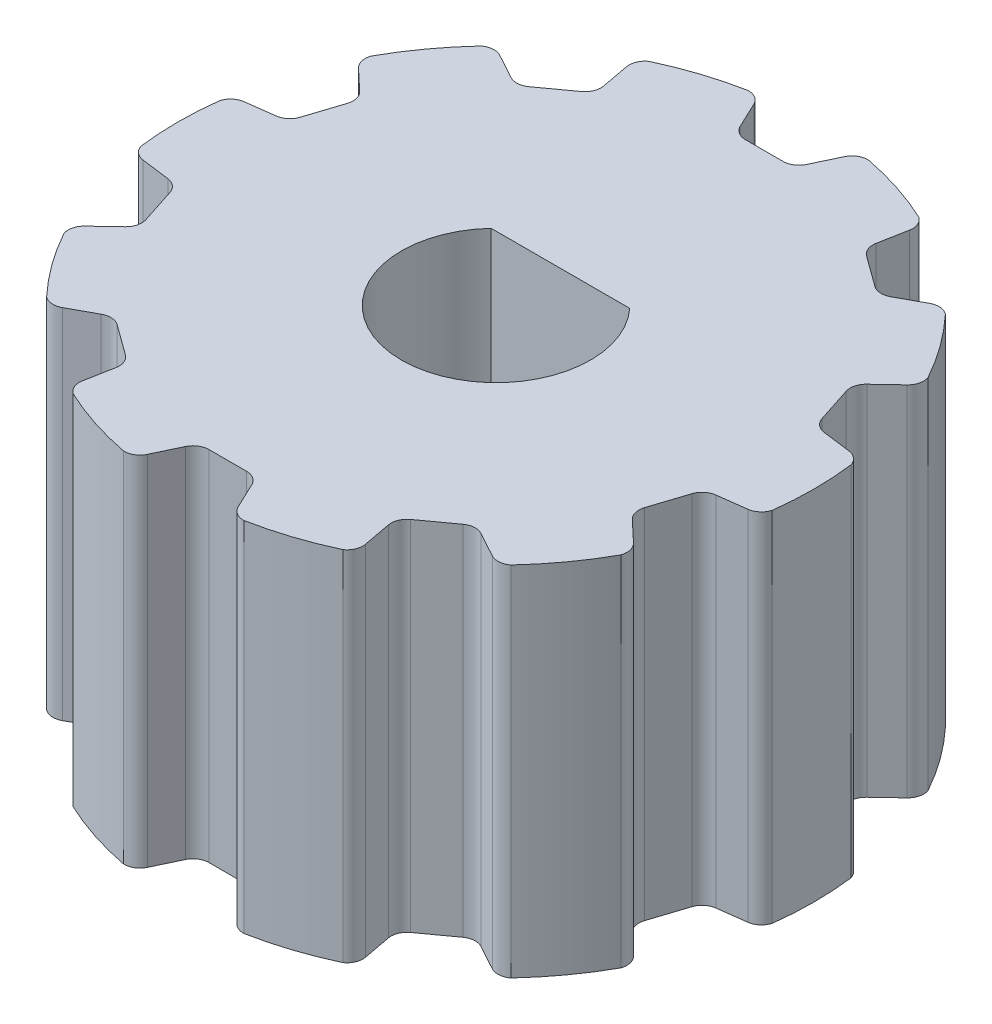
from build123d import *

# Parameters (mm, degrees)
SKETCH1_R          = 8
EXTRUDE1_DEPTH     = 4.5
CUT_EXTRUDE1_DEPTH = 26
CIRPATTERN1_COUNT  = 10
EXTRUDE2_DEPTH     = 30


with BuildPart() as part:
    # Sketch1 → Extrude1 (new, symmetric)
    with BuildSketch(Plane(origin=(0, 0, 0), x_dir=(0, 0, -1), z_dir=(0, 1, 0))):
        with Locations(Location((0, 0, 0), (0, 0, 180))):
            Circle(SKETCH1_R)
    extrude(amount=EXTRUDE1_DEPTH, both=True)

    # Sketch2 → Cut-Extrude1 (cut)
    with BuildSketch(Plane(origin=(0, 4.5, 0), x_dir=(1, 0, 0), z_dir=(0, 1, 0))):
        with BuildLine():
            Line((1.141368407, 7.62746815), (0.833435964, 6.978521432))
            ThreePointArc((0.833435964, 6.978521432), (0.685842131, 6.811923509), (0.472056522, 6.75))
            Line((0.472056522, 6.75), (-0.472056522, 6.75))
            ThreePointArc((-0.472056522, 6.75), (-0.685842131, 6.811923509), (-0.833435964, 6.978521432))
            Line((-0.833435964, 6.978521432), (-1.141368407, 7.62746815))
            ThreePointArc((-1.141368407, 7.62746815), (-1.316561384, 7.810015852), (-1.566247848, 7.850917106))
            Line((-1.566247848, 7.850917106), (-3, 7.620385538))
            Line((-3, 7.620385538), (0, 17.696825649))
            Line((0, 17.696825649), (3, 7.620385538))
            Line((3, 7.620385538), (1.566247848, 7.850917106))
            ThreePointArc((1.566247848, 7.850917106), (1.316561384, 7.810015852), (1.141368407, 7.62746815))
        make_face()
    cut_extrude1 = extrude(amount=-CUT_EXTRUDE1_DEPTH, mode=Mode.SUBTRACT)

    # CirPattern1: Cut-Extrude1 ×10 about axis
    cirpattern1_axis = Axis((0, 0, 0), (0, 1, 0))
    for i in range(1, CIRPATTERN1_COUNT):
        add(cut_extrude1.rotate(cirpattern1_axis, i * 360 / CIRPATTERN1_COUNT), mode=Mode.SUBTRACT)

    # Sketch3 → Extrude2 (cut)
    with BuildSketch(Plane(origin=(0, 4.5, 0), x_dir=(1, 0, 0), z_dir=(0, 1, 0))):
        with BuildLine():
            Line((1.743559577, 1.62), (-1.743559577, 1.62))
            ThreePointArc((-1.743559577, 1.62), (0, -2.38), (1.743559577, 1.62))
        make_face()
    extrude(amount=-EXTRUDE2_DEPTH, mode=Mode.SUBTRACT)


solid = part.part
